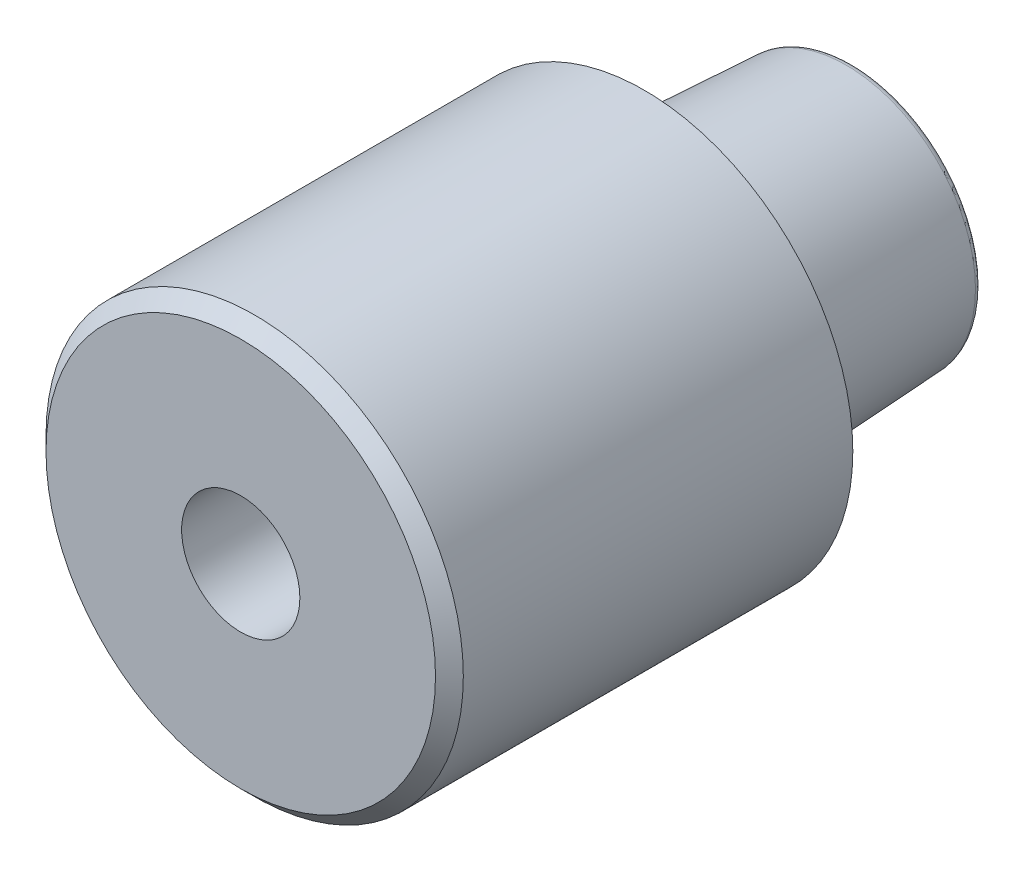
ISO-10303-21;
HEADER;
FILE_DESCRIPTION(('STEP AP214'),'2;1');
FILE_NAME('part.step','',(''),(''),'','','');
FILE_SCHEMA(('AUTOMOTIVE_DESIGN { 1 0 10303 214 1 1 1 1 }'));
ENDSEC;
DATA;
#1=APPLICATION_CONTEXT('core data for automotive mechanical design processes');
#2=APPLICATION_PROTOCOL_DEFINITION('international standard','automotive_design',2000,#1);
#3=PRODUCT_CONTEXT('',#1,'mechanical');
#4=PRODUCT('Part','Part','',(#3));
#5=PRODUCT_RELATED_PRODUCT_CATEGORY('part','',(#4));
#6=PRODUCT_DEFINITION_FORMATION('','',#4);
#7=PRODUCT_DEFINITION_CONTEXT('part definition',#1,'design');
#8=PRODUCT_DEFINITION('design','',#6,#7);
#9=PRODUCT_DEFINITION_SHAPE('','',#8);
#10=(LENGTH_UNIT() NAMED_UNIT(*) SI_UNIT(.MILLI.,.METRE.));
#11=(NAMED_UNIT(*) PLANE_ANGLE_UNIT() SI_UNIT($,.RADIAN.));
#12=(NAMED_UNIT(*) SI_UNIT($,.STERADIAN.) SOLID_ANGLE_UNIT());
#13=UNCERTAINTY_MEASURE_WITH_UNIT(LENGTH_MEASURE(1.E-05),#10,'distance_accuracy_value','');
#14=(GEOMETRIC_REPRESENTATION_CONTEXT(3) GLOBAL_UNCERTAINTY_ASSIGNED_CONTEXT((#13)) GLOBAL_UNIT_ASSIGNED_CONTEXT((#10,
#11,#12)) REPRESENTATION_CONTEXT('',''));
#15=CARTESIAN_POINT('',(0.,0.,0.));
#16=DIRECTION('',(0.,0.,1.));
#17=DIRECTION('',(1.,0.,0.));
#18=AXIS2_PLACEMENT_3D('',#15,#16,#17);
#19=CARTESIAN_POINT('',(1.5911934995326E-13,0.,22.7867965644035));
#20=DIRECTION('',(0.,0.,-1.));
#21=DIRECTION('',(1.,0.,0.));
#22=AXIS2_PLACEMENT_3D('',#19,#20,#21);
#23=CONICAL_SURFACE('',#22,21.2132034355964,0.785398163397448);
#24=CARTESIAN_POINT('',(2.09488880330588E-13,0.,30.));
#25=DIRECTION('',(0.,0.,-1.));
#26=DIRECTION('',(-1.,0.,0.));
#27=AXIS2_PLACEMENT_3D('',#24,#25,#26);
#28=CIRCLE('',#27,14.);
#29=CARTESIAN_POINT('',(-13.9999999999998,0.,30.));
#30=VERTEX_POINT('',#29);
#31=CARTESIAN_POINT('',(14.0000000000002,0.,30.));
#32=VERTEX_POINT('',#31);
#33=EDGE_CURVE('E59',#30,#32,#28,.T.);
#34=ORIENTED_EDGE('',*,*,#33,.T.);
#35=CARTESIAN_POINT('',(14.0000009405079,0.,29.9999990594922));
#36=CARTESIAN_POINT('',(15.0000023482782,0.,28.9999976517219));
#37=B_SPLINE_CURVE_WITH_KNOTS('',1,(#35,#36),.UNSPECIFIED.,.F.,.F.,(2,2),(0.659966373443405,
0.707106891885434),.UNSPECIFIED.);
#38=CARTESIAN_POINT('',(15.,0.,29.));
#39=VERTEX_POINT('',#38);
#40=EDGE_CURVE('E46',#32,#39,#37,.T.);
#41=ORIENTED_EDGE('',*,*,#40,.T.);
#42=CARTESIAN_POINT('',(2.02505917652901E-13,0.,29.));
#43=DIRECTION('',(0.,0.,1.));
#44=DIRECTION('',(-1.,0.,0.));
#45=AXIS2_PLACEMENT_3D('',#42,#43,#44);
#46=CIRCLE('',#45,15.);
#47=CARTESIAN_POINT('',(-14.9999999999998,0.,29.));
#48=VERTEX_POINT('',#47);
#49=EDGE_CURVE('E97',#39,#48,#46,.T.);
#50=ORIENTED_EDGE('',*,*,#49,.T.);
#51=CARTESIAN_POINT('',(2.02505917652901E-13,0.,29.));
#52=DIRECTION('',(0.,0.,1.));
#53=DIRECTION('',(-1.,0.,0.));
#54=AXIS2_PLACEMENT_3D('',#51,#52,#53);
#55=CIRCLE('',#54,15.);
#56=EDGE_CURVE('E11',#48,#39,#55,.T.);
#57=ORIENTED_EDGE('',*,*,#56,.T.);
#58=ORIENTED_EDGE('',*,*,#40,.F.);
#59=CARTESIAN_POINT('',(2.09488880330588E-13,0.,30.));
#60=DIRECTION('',(0.,0.,-1.));
#61=DIRECTION('',(-1.,0.,0.));
#62=AXIS2_PLACEMENT_3D('',#59,#60,#61);
#63=CIRCLE('',#62,14.);
#64=EDGE_CURVE('E94',#32,#30,#63,.T.);
#65=ORIENTED_EDGE('',*,*,#64,.T.);
#66=EDGE_LOOP('',(#34,#41,#50,#57,#58,#65));
#67=FACE_BOUND('',#66,.T.);
#68=ADVANCED_FACE('F38',(#67),#23,.T.);
#69=CARTESIAN_POINT('',(1.08235921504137E-13,0.,15.5));
#70=DIRECTION('',(0.,0.,-1.));
#71=DIRECTION('',(-1.,0.,0.));
#72=AXIS2_PLACEMENT_3D('',#69,#70,#71);
#73=CYLINDRICAL_SURFACE('',#72,15.);
#74=ORIENTED_EDGE('',*,*,#49,.F.);
#75=ORIENTED_EDGE('',*,*,#56,.F.);
#76=CARTESIAN_POINT('',(-14.9999999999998,0.,29.0000010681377));
#77=CARTESIAN_POINT('',(-15.,0.,1.00000036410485));
#78=B_SPLINE_CURVE_WITH_KNOTS('',1,(#76,#77),.UNSPECIFIED.,.F.,.F.,(2,2),(0.0833333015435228,
0.916666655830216),.UNSPECIFIED.);
#79=CARTESIAN_POINT('',(-15.,0.,1.0000000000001));
#80=VERTEX_POINT('',#79);
#81=EDGE_CURVE('E132',#48,#80,#78,.T.);
#82=ORIENTED_EDGE('',*,*,#81,.T.);
#83=CARTESIAN_POINT('',(0.,0.,1.));
#84=DIRECTION('',(0.,0.,-1.));
#85=DIRECTION('',(-1.,0.,0.));
#86=AXIS2_PLACEMENT_3D('',#83,#84,#85);
#87=CIRCLE('',#86,15.);
#88=EDGE_CURVE('E137',#80,#80,#87,.T.);
#89=ORIENTED_EDGE('',*,*,#88,.F.);
#90=ORIENTED_EDGE('',*,*,#81,.F.);
#91=EDGE_LOOP('',(#74,#75,#82,#89,#90));
#92=FACE_BOUND('',#91,.T.);
#93=ADVANCED_FACE('F182',(#92),#73,.T.);
#94=CARTESIAN_POINT('',(-18.2,-29.0984535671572,30.));
#95=DIRECTION('',(0.,0.,1.));
#96=DIRECTION('',(1.,0.,0.));
#97=AXIS2_PLACEMENT_3D('',#94,#95,#96);
#98=PLANE('',#97);
#99=CARTESIAN_POINT('',(0.,0.,29.9999999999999));
#100=DIRECTION('',(0.,0.,1.));
#101=DIRECTION('',(1.,0.,0.));
#102=AXIS2_PLACEMENT_3D('',#99,#100,#101);
#103=CIRCLE('',#102,4.24999999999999);
#104=CARTESIAN_POINT('',(4.24999999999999,0.,29.9999999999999));
#105=VERTEX_POINT('',#104);
#106=EDGE_CURVE('E95',#105,#105,#103,.T.);
#107=ORIENTED_EDGE('',*,*,#106,.F.);
#108=EDGE_LOOP('',(#107));
#109=FACE_BOUND('',#108,.T.);
#110=ORIENTED_EDGE('',*,*,#64,.F.);
#111=ORIENTED_EDGE('',*,*,#33,.F.);
#112=EDGE_LOOP('',(#110,#111));
#113=FACE_BOUND('',#112,.T.);
#114=ADVANCED_FACE('F185',(#109,#113),#98,.T.);
#115=CARTESIAN_POINT('',(0.,0.,-13.5));
#116=DIRECTION('',(0.,0.,-1.));
#117=DIRECTION('',(-1.,0.,0.));
#118=AXIS2_PLACEMENT_3D('',#115,#116,#117);
#119=TOROIDAL_SURFACE('',#118,8.79180880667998,0.5);
#120=CARTESIAN_POINT('',(0.,0.,-13.5261679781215));
#121=DIRECTION('',(0.,0.,-1.));
#122=DIRECTION('',(-1.,0.,0.));
#123=AXIS2_PLACEMENT_3D('',#120,#121,#122);
#124=CIRCLE('',#123,9.29112357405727);
#125=CARTESIAN_POINT('',(-9.29112357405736,0.,-13.5261679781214));
#126=VERTEX_POINT('',#125);
#127=EDGE_CURVE('E138',#126,#126,#124,.T.);
#128=ORIENTED_EDGE('',*,*,#127,.T.);
#129=CARTESIAN_POINT('',(-9.29112357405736,0.,-13.5261679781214));
#130=CARTESIAN_POINT('',(-9.26629109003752,0.,-13.9999999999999));
#131=CARTESIAN_POINT('',(-8.79180880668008,0.,-14.));
#132=(BOUNDED_CURVE() B_SPLINE_CURVE(2,(#129,#130,#131),.UNSPECIFIED.,.F.,
.F.) B_SPLINE_CURVE_WITH_KNOTS((3,3),(0.,0.5),
.UNSPECIFIED.) CURVE() GEOMETRIC_REPRESENTATION_ITEM() RATIONAL_B_SPLINE_CURVE((1.,
0.725374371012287,1.)) REPRESENTATION_ITEM(''));
#133=CARTESIAN_POINT('',(-8.79180880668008,0.,-14.));
#134=VERTEX_POINT('',#133);
#135=EDGE_CURVE('E121',#126,#134,#132,.T.);
#136=ORIENTED_EDGE('',*,*,#135,.T.);
#137=CARTESIAN_POINT('',(0.,0.,-14.));
#138=DIRECTION('',(0.,0.,1.));
#139=DIRECTION('',(-1.,0.,0.));
#140=AXIS2_PLACEMENT_3D('',#137,#138,#139);
#141=CIRCLE('',#140,8.79180880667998);
#142=EDGE_CURVE('E127',#134,#134,#141,.T.);
#143=ORIENTED_EDGE('',*,*,#142,.T.);
#144=ORIENTED_EDGE('',*,*,#135,.F.);
#145=EDGE_LOOP('',(#128,#136,#143,#144));
#146=FACE_BOUND('',#145,.T.);
#147=ADVANCED_FACE('F187',(#146),#119,.T.);
#148=CARTESIAN_POINT('',(0.,0.,0.));
#149=DIRECTION('',(0.,0.,1.));
#150=DIRECTION('',(-1.,0.,0.));
#151=AXIS2_PLACEMENT_3D('',#148,#149,#150);
#152=CONICAL_SURFACE('',#151,10.,0.0523598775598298);
#153=ORIENTED_EDGE('',*,*,#127,.F.);
#154=CARTESIAN_POINT('',(-9.29112357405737,0.,-13.5261679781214));
#155=CARTESIAN_POINT('',(-10.,0.,0.));
#156=B_SPLINE_CURVE_WITH_KNOTS('',1,(#154,#155),.UNSPECIFIED.,.F.,.F.,(2,2),(0.,1.),.UNSPECIFIED.);
#157=CARTESIAN_POINT('',(-10.,0.,0.));
#158=VERTEX_POINT('',#157);
#159=EDGE_CURVE('E110',#126,#158,#156,.T.);
#160=ORIENTED_EDGE('',*,*,#159,.T.);
#161=CARTESIAN_POINT('',(0.,0.,0.));
#162=DIRECTION('',(0.,0.,-1.));
#163=DIRECTION('',(-1.,0.,0.));
#164=AXIS2_PLACEMENT_3D('',#161,#162,#163);
#165=CIRCLE('',#164,10.);
#166=EDGE_CURVE('E116',#158,#158,#165,.T.);
#167=ORIENTED_EDGE('',*,*,#166,.T.);
#168=ORIENTED_EDGE('',*,*,#159,.F.);
#169=EDGE_LOOP('',(#153,#160,#167,#168));
#170=FACE_BOUND('',#169,.T.);
#171=ADVANCED_FACE('F194',(#170),#152,.T.);
#172=CARTESIAN_POINT('',(20.2211602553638,-18.2734314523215,-14.0000000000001));
#173=DIRECTION('',(0.,0.,-1.));
#174=DIRECTION('',(-1.,0.,0.));
#175=AXIS2_PLACEMENT_3D('',#172,#173,#174);
#176=PLANE('',#175);
#177=ORIENTED_EDGE('',*,*,#142,.F.);
#178=EDGE_LOOP('',(#177));
#179=FACE_BOUND('',#178,.T.);
#180=ADVANCED_FACE('F222',(#179),#176,.T.);
#181=CARTESIAN_POINT('',(0.,0.,0.5));
#182=DIRECTION('',(0.,0.,-1.));
#183=DIRECTION('',(-1.,0.,0.));
#184=AXIS2_PLACEMENT_3D('',#181,#182,#183);
#185=CYLINDRICAL_SURFACE('',#184,10.);
#186=CARTESIAN_POINT('',(0.,0.,1.));
#187=DIRECTION('',(0.,0.,1.));
#188=DIRECTION('',(-1.,0.,0.));
#189=AXIS2_PLACEMENT_3D('',#186,#187,#188);
#190=CIRCLE('',#189,10.);
#191=CARTESIAN_POINT('',(-10.,0.,1.00000000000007));
#192=VERTEX_POINT('',#191);
#193=EDGE_CURVE('E105',#192,#192,#190,.T.);
#194=ORIENTED_EDGE('',*,*,#193,.F.);
#195=CARTESIAN_POINT('',(-10.,0.,1.00000305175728));
#196=CARTESIAN_POINT('',(-10.,0.,5.31746945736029E-07));
#197=B_SPLINE_CURVE_WITH_KNOTS('',1,(#195,#196),.UNSPECIFIED.,.F.,.F.,(2,2),(0.0833307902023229,
0.91666622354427),.UNSPECIFIED.);
#198=EDGE_CURVE('E102',#192,#158,#197,.T.);
#199=ORIENTED_EDGE('',*,*,#198,.T.);
#200=ORIENTED_EDGE('',*,*,#166,.F.);
#201=ORIENTED_EDGE('',*,*,#198,.F.);
#202=EDGE_LOOP('',(#194,#199,#200,#201));
#203=FACE_BOUND('',#202,.T.);
#204=ADVANCED_FACE('F231',(#203),#185,.T.);
#205=CARTESIAN_POINT('',(34.5,-31.1769145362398,0.999999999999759));
#206=DIRECTION('',(0.,0.,-1.));
#207=DIRECTION('',(-1.,0.,0.));
#208=AXIS2_PLACEMENT_3D('',#205,#206,#207);
#209=PLANE('',#208);
#210=ORIENTED_EDGE('',*,*,#88,.T.);
#211=EDGE_LOOP('',(#210));
#212=FACE_BOUND('',#211,.T.);
#213=ORIENTED_EDGE('',*,*,#193,.T.);
#214=EDGE_LOOP('',(#213));
#215=FACE_BOUND('',#214,.T.);
#216=ADVANCED_FACE('F88',(#212,#215),#209,.T.);
#217=CARTESIAN_POINT('',(0.,0.,7.99999999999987));
#218=DIRECTION('',(0.,0.,1.));
#219=DIRECTION('',(1.,0.,0.));
#220=AXIS2_PLACEMENT_3D('',#217,#218,#219);
#221=CONICAL_SURFACE('',#220,4.24999999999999,1.02974425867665);
#222=CARTESIAN_POINT('',(0.,0.,5.44634236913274));
#223=VERTEX_POINT('',#222);
#224=VERTEX_LOOP('',#223);
#225=FACE_BOUND('',#224,.T.);
#226=CARTESIAN_POINT('',(0.,0.,7.99999999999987));
#227=DIRECTION('',(0.,0.,1.));
#228=DIRECTION('',(1.,0.,0.));
#229=AXIS2_PLACEMENT_3D('',#226,#227,#228);
#230=CIRCLE('',#229,4.24999999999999);
#231=CARTESIAN_POINT('',(4.24999999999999,0.,7.99999999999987));
#232=VERTEX_POINT('',#231);
#233=EDGE_CURVE('E92',#232,#232,#230,.T.);
#234=ORIENTED_EDGE('',*,*,#233,.T.);
#235=EDGE_LOOP('',(#234));
#236=FACE_BOUND('',#235,.T.);
#237=ADVANCED_FACE('F84',(#225,#236),#221,.F.);
#238=CARTESIAN_POINT('',(0.,0.,29.9999999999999));
#239=DIRECTION('',(0.,0.,1.));
#240=DIRECTION('',(1.,0.,0.));
#241=AXIS2_PLACEMENT_3D('',#238,#239,#240);
#242=CYLINDRICAL_SURFACE('',#241,4.24999999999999);
#243=ORIENTED_EDGE('',*,*,#233,.F.);
#244=EDGE_LOOP('',(#243));
#245=FACE_BOUND('',#244,.T.);
#246=ORIENTED_EDGE('',*,*,#106,.T.);
#247=EDGE_LOOP('',(#246));
#248=FACE_BOUND('',#247,.T.);
#249=ADVANCED_FACE('F87',(#245,#248),#242,.F.);
#250=CLOSED_SHELL('',(#68,#93,#114,#147,#171,#180,#204,#216,#237,#249));
#251=MANIFOLD_SOLID_BREP('B2',#250);
#252=ADVANCED_BREP_SHAPE_REPRESENTATION('',(#18,#251),#14);
#253=SHAPE_DEFINITION_REPRESENTATION(#9,#252);
ENDSEC;
END-ISO-10303-21;
